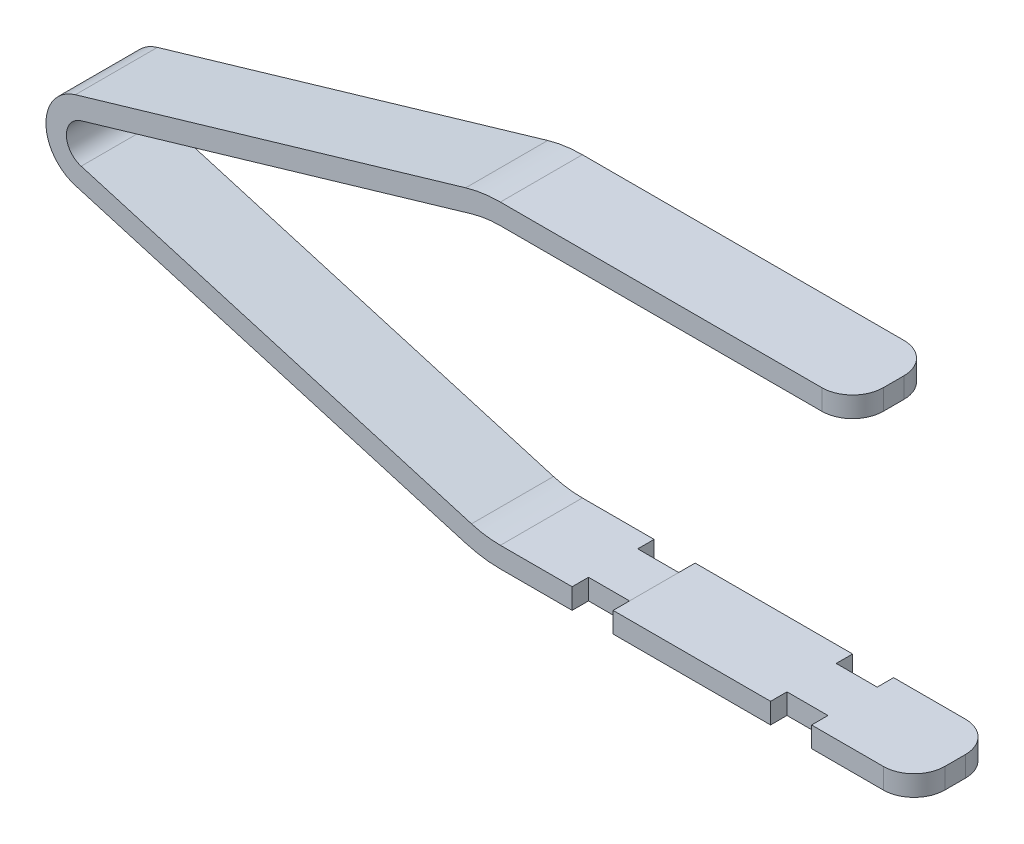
ISO-10303-21;
HEADER;
FILE_DESCRIPTION(('STEP AP214'),'2;1');
FILE_NAME('part.step','',(''),(''),'','','');
FILE_SCHEMA(('AUTOMOTIVE_DESIGN { 1 0 10303 214 1 1 1 1 }'));
ENDSEC;
DATA;
#1=APPLICATION_CONTEXT('core data for automotive mechanical design processes');
#2=APPLICATION_PROTOCOL_DEFINITION('international standard','automotive_design',2000,#1);
#3=PRODUCT_CONTEXT('',#1,'mechanical');
#4=PRODUCT('Part','Part','',(#3));
#5=PRODUCT_RELATED_PRODUCT_CATEGORY('part','',(#4));
#6=PRODUCT_DEFINITION_FORMATION('','',#4);
#7=PRODUCT_DEFINITION_CONTEXT('part definition',#1,'design');
#8=PRODUCT_DEFINITION('design','',#6,#7);
#9=PRODUCT_DEFINITION_SHAPE('','',#8);
#10=(LENGTH_UNIT() NAMED_UNIT(*) SI_UNIT(.MILLI.,.METRE.));
#11=(NAMED_UNIT(*) PLANE_ANGLE_UNIT() SI_UNIT($,.RADIAN.));
#12=(NAMED_UNIT(*) SI_UNIT($,.STERADIAN.) SOLID_ANGLE_UNIT());
#13=UNCERTAINTY_MEASURE_WITH_UNIT(LENGTH_MEASURE(1.E-05),#10,'distance_accuracy_value','');
#14=(GEOMETRIC_REPRESENTATION_CONTEXT(3) GLOBAL_UNCERTAINTY_ASSIGNED_CONTEXT((#13)) GLOBAL_UNIT_ASSIGNED_CONTEXT((#10,
#11,#12)) REPRESENTATION_CONTEXT('',''));
#15=CARTESIAN_POINT('',(0.,0.,0.));
#16=DIRECTION('',(0.,0.,1.));
#17=DIRECTION('',(1.,0.,0.));
#18=AXIS2_PLACEMENT_3D('',#15,#16,#17);
#19=CARTESIAN_POINT('',(60.2450998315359,-4.445,-5.08));
#20=DIRECTION('',(0.,0.,1.));
#21=DIRECTION('',(1.,0.,0.));
#22=AXIS2_PLACEMENT_3D('',#19,#20,#21);
#23=PLANE('',#22);
#24=DIRECTION('',(-1.,0.,0.));
#25=VECTOR('',#24,1.);
#26=CARTESIAN_POINT('',(60.2450998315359,17.145,-5.08));
#27=LINE('',#26,#25);
#28=CARTESIAN_POINT('',(100.076,17.145,-5.08));
#29=VERTEX_POINT('',#28);
#30=CARTESIAN_POINT('',(60.2450998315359,17.145,-5.08));
#31=VERTEX_POINT('',#30);
#32=EDGE_CURVE('E281',#29,#31,#27,.T.);
#33=ORIENTED_EDGE('',*,*,#32,.T.);
#34=CARTESIAN_POINT('',(60.2450998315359,4.445,-5.08));
#35=DIRECTION('',(0.,0.,1.));
#36=DIRECTION('',(-1.,0.,0.));
#37=AXIS2_PLACEMENT_3D('',#34,#35,#36);
#38=CIRCLE('',#37,12.7);
#39=CARTESIAN_POINT('',(56.6687593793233,16.6310489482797,-5.08));
#40=VERTEX_POINT('',#39);
#41=EDGE_CURVE('E619',#31,#40,#38,.T.);
#42=ORIENTED_EDGE('',*,*,#41,.T.);
#43=DIRECTION('',(-0.959531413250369,-0.281601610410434,0.));
#44=VECTOR('',#43,1.);
#45=CARTESIAN_POINT('',(8.30456669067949,2.43720978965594,-5.08));
#46=LINE('',#45,#44);
#47=CARTESIAN_POINT('',(8.30456669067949,2.43720978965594,-5.08));
#48=VERTEX_POINT('',#47);
#49=EDGE_CURVE('E624',#40,#48,#46,.T.);
#50=ORIENTED_EDGE('',*,*,#49,.T.);
#51=CARTESIAN_POINT('',(9.01983478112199,0.,-5.08));
#52=DIRECTION('',(0.,0.,1.));
#53=DIRECTION('',(1.,0.,0.));
#54=AXIS2_PLACEMENT_3D('',#51,#52,#53);
#55=CIRCLE('',#54,2.54);
#56=CARTESIAN_POINT('',(8.30456669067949,-2.43720978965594,-5.08));
#57=VERTEX_POINT('',#56);
#58=EDGE_CURVE('E627',#48,#57,#55,.T.);
#59=ORIENTED_EDGE('',*,*,#58,.T.);
#60=DIRECTION('',(0.959531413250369,-0.281601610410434,0.));
#61=VECTOR('',#60,1.);
#62=CARTESIAN_POINT('',(8.30456669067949,-2.43720978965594,-5.08));
#63=LINE('',#62,#61);
#64=CARTESIAN_POINT('',(56.6687593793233,-16.6310489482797,-5.08));
#65=VERTEX_POINT('',#64);
#66=EDGE_CURVE('E635',#57,#65,#63,.T.);
#67=ORIENTED_EDGE('',*,*,#66,.T.);
#68=CARTESIAN_POINT('',(60.2450998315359,-4.445,-5.08));
#69=DIRECTION('',(0.,0.,1.));
#70=DIRECTION('',(-1.,0.,0.));
#71=AXIS2_PLACEMENT_3D('',#68,#69,#70);
#72=CIRCLE('',#71,12.7);
#73=CARTESIAN_POINT('',(60.2450998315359,-17.145,-5.08));
#74=VERTEX_POINT('',#73);
#75=EDGE_CURVE('E264',#65,#74,#72,.T.);
#76=ORIENTED_EDGE('',*,*,#75,.T.);
#77=DIRECTION('',(1.,0.,0.));
#78=VECTOR('',#77,1.);
#79=CARTESIAN_POINT('',(60.2450998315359,-17.145,-5.08));
#80=LINE('',#79,#78);
#81=CARTESIAN_POINT('',(69.1350998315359,-17.145,-5.08));
#82=VERTEX_POINT('',#81);
#83=EDGE_CURVE('E230',#74,#82,#80,.T.);
#84=ORIENTED_EDGE('',*,*,#83,.T.);
#85=DIRECTION('',(0.,-1.,0.));
#86=VECTOR('',#85,1.);
#87=CARTESIAN_POINT('',(69.1350998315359,19.686,-5.08));
#88=LINE('',#87,#86);
#89=CARTESIAN_POINT('',(69.1350998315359,-19.685,-5.08));
#90=VERTEX_POINT('',#89);
#91=EDGE_CURVE('E240',#82,#90,#88,.T.);
#92=ORIENTED_EDGE('',*,*,#91,.T.);
#93=DIRECTION('',(1.,0.,0.));
#94=VECTOR('',#93,1.);
#95=CARTESIAN_POINT('',(60.2450998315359,-19.685,-5.08));
#96=LINE('',#95,#94);
#97=CARTESIAN_POINT('',(60.2450998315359,-19.685,-5.08));
#98=VERTEX_POINT('',#97);
#99=EDGE_CURVE('E225',#98,#90,#96,.T.);
#100=ORIENTED_EDGE('',*,*,#99,.F.);
#101=CARTESIAN_POINT('',(60.2450998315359,-4.445,-5.08));
#102=DIRECTION('',(0.,0.,1.));
#103=DIRECTION('',(1.,0.,0.));
#104=AXIS2_PLACEMENT_3D('',#101,#102,#103);
#105=CIRCLE('',#104,15.24);
#106=CARTESIAN_POINT('',(55.9534912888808,-19.0682587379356,-5.08));
#107=VERTEX_POINT('',#106);
#108=EDGE_CURVE('E262',#107,#98,#105,.T.);
#109=ORIENTED_EDGE('',*,*,#108,.F.);
#110=DIRECTION('',(0.959531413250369,-0.281601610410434,0.));
#111=VECTOR('',#110,1.);
#112=CARTESIAN_POINT('',(7.58929860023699,-4.87441957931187,-5.08));
#113=LINE('',#112,#111);
#114=CARTESIAN_POINT('',(7.58929860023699,-4.87441957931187,-5.08));
#115=VERTEX_POINT('',#114);
#116=EDGE_CURVE('E654',#115,#107,#113,.T.);
#117=ORIENTED_EDGE('',*,*,#116,.F.);
#118=CARTESIAN_POINT('',(9.01983478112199,0.,-5.08));
#119=DIRECTION('',(0.,0.,1.));
#120=DIRECTION('',(1.,0.,0.));
#121=AXIS2_PLACEMENT_3D('',#118,#119,#120);
#122=CIRCLE('',#121,5.08);
#123=CARTESIAN_POINT('',(7.58929860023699,4.87441957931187,-5.08));
#124=VERTEX_POINT('',#123);
#125=EDGE_CURVE('E650',#124,#115,#122,.T.);
#126=ORIENTED_EDGE('',*,*,#125,.F.);
#127=DIRECTION('',(-0.959531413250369,-0.281601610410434,0.));
#128=VECTOR('',#127,1.);
#129=CARTESIAN_POINT('',(7.58929860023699,4.87441957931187,-5.08));
#130=LINE('',#129,#128);
#131=CARTESIAN_POINT('',(55.9534912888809,19.0682587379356,-5.08));
#132=VERTEX_POINT('',#131);
#133=EDGE_CURVE('E629',#132,#124,#130,.T.);
#134=ORIENTED_EDGE('',*,*,#133,.F.);
#135=CARTESIAN_POINT('',(60.2450998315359,4.445,-5.08));
#136=DIRECTION('',(0.,0.,1.));
#137=DIRECTION('',(1.,0.,0.));
#138=AXIS2_PLACEMENT_3D('',#135,#136,#137);
#139=CIRCLE('',#138,15.24);
#140=CARTESIAN_POINT('',(60.2450998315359,19.685,-5.08));
#141=VERTEX_POINT('',#140);
#142=EDGE_CURVE('E625',#141,#132,#139,.T.);
#143=ORIENTED_EDGE('',*,*,#142,.F.);
#144=DIRECTION('',(1.,0.,0.));
#145=VECTOR('',#144,1.);
#146=CARTESIAN_POINT('',(60.2450998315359,19.685,-5.08));
#147=LINE('',#146,#145);
#148=CARTESIAN_POINT('',(100.076,19.685,-5.08));
#149=VERTEX_POINT('',#148);
#150=EDGE_CURVE('E284',#149,#141,#147,.F.);
#151=ORIENTED_EDGE('',*,*,#150,.F.);
#152=DIRECTION('',(0.,1.,0.));
#153=VECTOR('',#152,1.);
#154=CARTESIAN_POINT('',(100.076,17.145,-5.08));
#155=LINE('',#154,#153);
#156=EDGE_CURVE('E269',#149,#29,#155,.F.);
#157=ORIENTED_EDGE('',*,*,#156,.T.);
#158=EDGE_LOOP('',(#33,#42,#50,#59,#67,#76,#84,#92,#100,#109,#117,#126,#134,#143,#151,#157));
#159=FACE_BOUND('',#158,.T.);
#160=ADVANCED_FACE('F46',(#159),#23,.F.);
#161=CARTESIAN_POINT('',(60.2450998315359,-4.445,5.08));
#162=DIRECTION('',(0.,0.,1.));
#163=DIRECTION('',(1.,0.,0.));
#164=AXIS2_PLACEMENT_3D('',#161,#162,#163);
#165=PLANE('',#164);
#166=DIRECTION('',(1.,0.,0.));
#167=VECTOR('',#166,1.);
#168=CARTESIAN_POINT('',(60.2450998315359,19.685,5.08));
#169=LINE('',#168,#167);
#170=CARTESIAN_POINT('',(100.076,19.685,5.08));
#171=VERTEX_POINT('',#170);
#172=CARTESIAN_POINT('',(60.2450998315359,19.685,5.08));
#173=VERTEX_POINT('',#172);
#174=EDGE_CURVE('E50',#171,#173,#169,.F.);
#175=ORIENTED_EDGE('',*,*,#174,.T.);
#176=CARTESIAN_POINT('',(60.2450998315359,4.445,5.08));
#177=DIRECTION('',(0.,0.,1.));
#178=DIRECTION('',(1.,0.,0.));
#179=AXIS2_PLACEMENT_3D('',#176,#177,#178);
#180=CIRCLE('',#179,15.24);
#181=CARTESIAN_POINT('',(55.9534912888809,19.0682587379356,5.08));
#182=VERTEX_POINT('',#181);
#183=EDGE_CURVE('E294',#173,#182,#180,.T.);
#184=ORIENTED_EDGE('',*,*,#183,.T.);
#185=DIRECTION('',(-0.959531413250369,-0.281601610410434,0.));
#186=VECTOR('',#185,1.);
#187=CARTESIAN_POINT('',(7.58929860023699,4.87441957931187,5.08));
#188=LINE('',#187,#186);
#189=CARTESIAN_POINT('',(7.58929860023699,4.87441957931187,5.08));
#190=VERTEX_POINT('',#189);
#191=EDGE_CURVE('E311',#182,#190,#188,.T.);
#192=ORIENTED_EDGE('',*,*,#191,.T.);
#193=CARTESIAN_POINT('',(9.01983478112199,0.,5.08));
#194=DIRECTION('',(0.,0.,1.));
#195=DIRECTION('',(1.,0.,0.));
#196=AXIS2_PLACEMENT_3D('',#193,#194,#195);
#197=CIRCLE('',#196,5.08);
#198=CARTESIAN_POINT('',(7.58929860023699,-4.87441957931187,5.08));
#199=VERTEX_POINT('',#198);
#200=EDGE_CURVE('E316',#190,#199,#197,.T.);
#201=ORIENTED_EDGE('',*,*,#200,.T.);
#202=DIRECTION('',(0.959531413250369,-0.281601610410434,0.));
#203=VECTOR('',#202,1.);
#204=CARTESIAN_POINT('',(7.58929860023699,-4.87441957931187,5.08));
#205=LINE('',#204,#203);
#206=CARTESIAN_POINT('',(55.9534912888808,-19.0682587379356,5.08));
#207=VERTEX_POINT('',#206);
#208=EDGE_CURVE('E640',#199,#207,#205,.T.);
#209=ORIENTED_EDGE('',*,*,#208,.T.);
#210=CARTESIAN_POINT('',(60.2450998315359,-4.445,5.08));
#211=DIRECTION('',(0.,0.,1.));
#212=DIRECTION('',(1.,0.,0.));
#213=AXIS2_PLACEMENT_3D('',#210,#211,#212);
#214=CIRCLE('',#213,15.24);
#215=CARTESIAN_POINT('',(60.2450998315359,-19.685,5.08));
#216=VERTEX_POINT('',#215);
#217=EDGE_CURVE('E341',#207,#216,#214,.T.);
#218=ORIENTED_EDGE('',*,*,#217,.T.);
#219=DIRECTION('',(1.,0.,0.));
#220=VECTOR('',#219,1.);
#221=CARTESIAN_POINT('',(60.2450998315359,-19.685,5.08));
#222=LINE('',#221,#220);
#223=CARTESIAN_POINT('',(69.1350998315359,-19.685,5.08));
#224=VERTEX_POINT('',#223);
#225=EDGE_CURVE('E258',#216,#224,#222,.T.);
#226=ORIENTED_EDGE('',*,*,#225,.T.);
#227=DIRECTION('',(0.,-1.,0.));
#228=VECTOR('',#227,1.);
#229=CARTESIAN_POINT('',(69.1350998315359,19.686,5.08));
#230=LINE('',#229,#228);
#231=CARTESIAN_POINT('',(69.1350998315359,-17.145,5.08));
#232=VERTEX_POINT('',#231);
#233=EDGE_CURVE('E235',#232,#224,#230,.T.);
#234=ORIENTED_EDGE('',*,*,#233,.F.);
#235=DIRECTION('',(1.,0.,0.));
#236=VECTOR('',#235,1.);
#237=CARTESIAN_POINT('',(60.2450998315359,-17.145,5.08));
#238=LINE('',#237,#236);
#239=CARTESIAN_POINT('',(60.2450998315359,-17.145,5.08));
#240=VERTEX_POINT('',#239);
#241=EDGE_CURVE('E255',#240,#232,#238,.T.);
#242=ORIENTED_EDGE('',*,*,#241,.F.);
#243=CARTESIAN_POINT('',(60.2450998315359,-4.445,5.08));
#244=DIRECTION('',(0.,0.,1.));
#245=DIRECTION('',(-1.,0.,0.));
#246=AXIS2_PLACEMENT_3D('',#243,#244,#245);
#247=CIRCLE('',#246,12.7);
#248=CARTESIAN_POINT('',(56.6687593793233,-16.6310489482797,5.08));
#249=VERTEX_POINT('',#248);
#250=EDGE_CURVE('E259',#249,#240,#247,.T.);
#251=ORIENTED_EDGE('',*,*,#250,.F.);
#252=DIRECTION('',(0.959531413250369,-0.281601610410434,0.));
#253=VECTOR('',#252,1.);
#254=CARTESIAN_POINT('',(8.30456669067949,-2.43720978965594,5.08));
#255=LINE('',#254,#253);
#256=CARTESIAN_POINT('',(8.30456669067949,-2.43720978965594,5.08));
#257=VERTEX_POINT('',#256);
#258=EDGE_CURVE('E325',#257,#249,#255,.T.);
#259=ORIENTED_EDGE('',*,*,#258,.F.);
#260=CARTESIAN_POINT('',(9.01983478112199,0.,5.08));
#261=DIRECTION('',(0.,0.,1.));
#262=DIRECTION('',(1.,0.,0.));
#263=AXIS2_PLACEMENT_3D('',#260,#261,#262);
#264=CIRCLE('',#263,2.54);
#265=CARTESIAN_POINT('',(8.30456669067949,2.43720978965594,5.08));
#266=VERTEX_POINT('',#265);
#267=EDGE_CURVE('E322',#266,#257,#264,.T.);
#268=ORIENTED_EDGE('',*,*,#267,.F.);
#269=DIRECTION('',(-0.959531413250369,-0.281601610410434,0.));
#270=VECTOR('',#269,1.);
#271=CARTESIAN_POINT('',(8.30456669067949,2.43720978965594,5.08));
#272=LINE('',#271,#270);
#273=CARTESIAN_POINT('',(56.6687593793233,16.6310489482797,5.08));
#274=VERTEX_POINT('',#273);
#275=EDGE_CURVE('E314',#274,#266,#272,.T.);
#276=ORIENTED_EDGE('',*,*,#275,.F.);
#277=CARTESIAN_POINT('',(60.2450998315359,4.445,5.08));
#278=DIRECTION('',(0.,0.,1.));
#279=DIRECTION('',(-1.,0.,0.));
#280=AXIS2_PLACEMENT_3D('',#277,#278,#279);
#281=CIRCLE('',#280,12.7);
#282=CARTESIAN_POINT('',(60.2450998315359,17.145,5.08));
#283=VERTEX_POINT('',#282);
#284=EDGE_CURVE('E310',#283,#274,#281,.T.);
#285=ORIENTED_EDGE('',*,*,#284,.F.);
#286=DIRECTION('',(-1.,0.,0.));
#287=VECTOR('',#286,1.);
#288=CARTESIAN_POINT('',(60.2450998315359,17.145,5.08));
#289=LINE('',#288,#287);
#290=CARTESIAN_POINT('',(100.076,17.145,5.08));
#291=VERTEX_POINT('',#290);
#292=EDGE_CURVE('E285',#291,#283,#289,.T.);
#293=ORIENTED_EDGE('',*,*,#292,.F.);
#294=DIRECTION('',(0.,-1.,0.));
#295=VECTOR('',#294,1.);
#296=CARTESIAN_POINT('',(100.076,-4.445,5.08));
#297=LINE('',#296,#295);
#298=EDGE_CURVE('E248',#291,#171,#297,.F.);
#299=ORIENTED_EDGE('',*,*,#298,.T.);
#300=EDGE_LOOP('',(#175,#184,#192,#201,#209,#218,#226,#234,#242,#251,#259,#268,#276,#285,#293,#299));
#301=FACE_BOUND('',#300,.T.);
#302=ADVANCED_FACE('F292',(#301),#165,.T.);
#303=CARTESIAN_POINT('',(60.2450998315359,17.145,5.08));
#304=DIRECTION('',(0.,-1.,0.));
#305=DIRECTION('',(0.,0.,-1.));
#306=AXIS2_PLACEMENT_3D('',#303,#304,#305);
#307=PLANE('',#306);
#308=ORIENTED_EDGE('',*,*,#292,.T.);
#309=DIRECTION('',(0.,0.,-1.));
#310=VECTOR('',#309,1.);
#311=CARTESIAN_POINT('',(60.2450998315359,17.145,5.08));
#312=LINE('',#311,#310);
#313=EDGE_CURVE('E305',#283,#31,#312,.T.);
#314=ORIENTED_EDGE('',*,*,#313,.T.);
#315=ORIENTED_EDGE('',*,*,#32,.F.);
#316=CARTESIAN_POINT('',(100.076,17.145,-1.27));
#317=DIRECTION('',(0.,-1.,0.));
#318=DIRECTION('',(0.,0.,-1.));
#319=AXIS2_PLACEMENT_3D('',#316,#317,#318);
#320=CIRCLE('',#319,3.81);
#321=CARTESIAN_POINT('',(103.886,17.145,-1.27));
#322=VERTEX_POINT('',#321);
#323=EDGE_CURVE('E71',#29,#322,#320,.T.);
#324=ORIENTED_EDGE('',*,*,#323,.T.);
#325=DIRECTION('',(0.,0.,-1.));
#326=VECTOR('',#325,1.);
#327=CARTESIAN_POINT('',(103.886,17.145,5.08));
#328=LINE('',#327,#326);
#329=CARTESIAN_POINT('',(103.886,17.145,1.27));
#330=VERTEX_POINT('',#329);
#331=EDGE_CURVE('E13',#330,#322,#328,.T.);
#332=ORIENTED_EDGE('',*,*,#331,.F.);
#333=CARTESIAN_POINT('',(100.076,17.145,1.27));
#334=DIRECTION('',(0.,-1.,0.));
#335=DIRECTION('',(0.,0.,-1.));
#336=AXIS2_PLACEMENT_3D('',#333,#334,#335);
#337=CIRCLE('',#336,3.81);
#338=EDGE_CURVE('E63',#330,#291,#337,.T.);
#339=ORIENTED_EDGE('',*,*,#338,.T.);
#340=EDGE_LOOP('',(#308,#314,#315,#324,#332,#339));
#341=FACE_BOUND('',#340,.T.);
#342=ADVANCED_FACE('F48',(#341),#307,.T.);
#343=CARTESIAN_POINT('',(60.2450998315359,19.685,5.08));
#344=DIRECTION('',(0.,-1.,0.));
#345=DIRECTION('',(0.,0.,-1.));
#346=AXIS2_PLACEMENT_3D('',#343,#344,#345);
#347=PLANE('',#346);
#348=ORIENTED_EDGE('',*,*,#150,.T.);
#349=DIRECTION('',(0.,0.,-1.));
#350=VECTOR('',#349,1.);
#351=CARTESIAN_POINT('',(60.2450998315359,19.685,5.08));
#352=LINE('',#351,#350);
#353=EDGE_CURVE('E299',#173,#141,#352,.T.);
#354=ORIENTED_EDGE('',*,*,#353,.F.);
#355=ORIENTED_EDGE('',*,*,#174,.F.);
#356=CARTESIAN_POINT('',(100.076,19.685,1.27));
#357=DIRECTION('',(0.,-1.,0.));
#358=DIRECTION('',(0.,0.,-1.));
#359=AXIS2_PLACEMENT_3D('',#356,#357,#358);
#360=CIRCLE('',#359,3.81);
#361=CARTESIAN_POINT('',(103.886,19.685,1.27));
#362=VERTEX_POINT('',#361);
#363=EDGE_CURVE('E273',#171,#362,#360,.F.);
#364=ORIENTED_EDGE('',*,*,#363,.T.);
#365=DIRECTION('',(0.,0.,1.));
#366=VECTOR('',#365,1.);
#367=CARTESIAN_POINT('',(103.886,19.685,-5.08));
#368=LINE('',#367,#366);
#369=CARTESIAN_POINT('',(103.886,19.685,-1.27));
#370=VERTEX_POINT('',#369);
#371=EDGE_CURVE('E55',#370,#362,#368,.T.);
#372=ORIENTED_EDGE('',*,*,#371,.F.);
#373=CARTESIAN_POINT('',(100.076,19.685,-1.27));
#374=DIRECTION('',(0.,-1.,0.));
#375=DIRECTION('',(0.,0.,-1.));
#376=AXIS2_PLACEMENT_3D('',#373,#374,#375);
#377=CIRCLE('',#376,3.81);
#378=EDGE_CURVE('E271',#370,#149,#377,.F.);
#379=ORIENTED_EDGE('',*,*,#378,.T.);
#380=EDGE_LOOP('',(#348,#354,#355,#364,#372,#379));
#381=FACE_BOUND('',#380,.T.);
#382=ADVANCED_FACE('F300',(#381),#347,.F.);
#383=CARTESIAN_POINT('',(103.886,17.145,-5.08));
#384=DIRECTION('',(1.,0.,0.));
#385=DIRECTION('',(0.,0.,-1.));
#386=AXIS2_PLACEMENT_3D('',#383,#384,#385);
#387=PLANE('',#386);
#388=ORIENTED_EDGE('',*,*,#331,.T.);
#389=DIRECTION('',(0.,1.,0.));
#390=VECTOR('',#389,1.);
#391=CARTESIAN_POINT('',(103.886,19.685,-1.27));
#392=LINE('',#391,#390);
#393=EDGE_CURVE('E275',#322,#370,#392,.T.);
#394=ORIENTED_EDGE('',*,*,#393,.T.);
#395=ORIENTED_EDGE('',*,*,#371,.T.);
#396=DIRECTION('',(0.,-1.,0.));
#397=VECTOR('',#396,1.);
#398=CARTESIAN_POINT('',(103.886,17.145,1.27));
#399=LINE('',#398,#397);
#400=EDGE_CURVE('E278',#362,#330,#399,.T.);
#401=ORIENTED_EDGE('',*,*,#400,.T.);
#402=EDGE_LOOP('',(#388,#394,#395,#401));
#403=FACE_BOUND('',#402,.T.);
#404=ADVANCED_FACE('F377',(#403),#387,.T.);
#405=CARTESIAN_POINT('',(100.076,17.145,-1.27));
#406=DIRECTION('',(0.,-1.,0.));
#407=DIRECTION('',(0.,0.,-1.));
#408=AXIS2_PLACEMENT_3D('',#405,#406,#407);
#409=CYLINDRICAL_SURFACE('',#408,3.81);
#410=ORIENTED_EDGE('',*,*,#323,.F.);
#411=ORIENTED_EDGE('',*,*,#156,.F.);
#412=ORIENTED_EDGE('',*,*,#378,.F.);
#413=ORIENTED_EDGE('',*,*,#393,.F.);
#414=EDGE_LOOP('',(#410,#411,#412,#413));
#415=FACE_BOUND('',#414,.T.);
#416=ADVANCED_FACE('F384',(#415),#409,.T.);
#417=CARTESIAN_POINT('',(100.076,17.145,1.27));
#418=DIRECTION('',(0.,-1.,0.));
#419=DIRECTION('',(0.,0.,-1.));
#420=AXIS2_PLACEMENT_3D('',#417,#418,#419);
#421=CYLINDRICAL_SURFACE('',#420,3.81);
#422=ORIENTED_EDGE('',*,*,#363,.F.);
#423=ORIENTED_EDGE('',*,*,#298,.F.);
#424=ORIENTED_EDGE('',*,*,#338,.F.);
#425=ORIENTED_EDGE('',*,*,#400,.F.);
#426=EDGE_LOOP('',(#422,#423,#424,#425));
#427=FACE_BOUND('',#426,.T.);
#428=ADVANCED_FACE('F402',(#427),#421,.T.);
#429=CARTESIAN_POINT('',(74.2150998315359,-19.685,-5.08));
#430=DIRECTION('',(-1.,0.,0.));
#431=DIRECTION('',(0.,0.,1.));
#432=AXIS2_PLACEMENT_3D('',#429,#430,#431);
#433=PLANE('',#432);
#434=DIRECTION('',(0.,0.,1.));
#435=VECTOR('',#434,1.);
#436=CARTESIAN_POINT('',(74.2150998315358,-19.685,5.0800000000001));
#437=LINE('',#436,#435);
#438=CARTESIAN_POINT('',(74.2150998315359,-19.685,-3.048));
#439=VERTEX_POINT('',#438);
#440=CARTESIAN_POINT('',(74.2150998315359,-19.685,3.048));
#441=VERTEX_POINT('',#440);
#442=EDGE_CURVE('E203',#439,#441,#437,.T.);
#443=ORIENTED_EDGE('',*,*,#442,.F.);
#444=DIRECTION('',(0.,-1.,0.));
#445=VECTOR('',#444,1.);
#446=CARTESIAN_POINT('',(74.2150998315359,19.686,-3.048));
#447=LINE('',#446,#445);
#448=CARTESIAN_POINT('',(74.2150998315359,-17.145,-3.048));
#449=VERTEX_POINT('',#448);
#450=EDGE_CURVE('E239',#449,#439,#447,.T.);
#451=ORIENTED_EDGE('',*,*,#450,.F.);
#452=DIRECTION('',(0.,0.,1.));
#453=VECTOR('',#452,1.);
#454=CARTESIAN_POINT('',(74.2150998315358,-17.145,5.0800000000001));
#455=LINE('',#454,#453);
#456=CARTESIAN_POINT('',(74.2150998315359,-17.145,3.048));
#457=VERTEX_POINT('',#456);
#458=EDGE_CURVE('E205',#449,#457,#455,.T.);
#459=ORIENTED_EDGE('',*,*,#458,.T.);
#460=DIRECTION('',(0.,-1.,0.));
#461=VECTOR('',#460,1.);
#462=CARTESIAN_POINT('',(74.2150998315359,19.686,3.048));
#463=LINE('',#462,#461);
#464=EDGE_CURVE('E199',#457,#441,#463,.T.);
#465=ORIENTED_EDGE('',*,*,#464,.T.);
#466=EDGE_LOOP('',(#443,#451,#459,#465));
#467=FACE_BOUND('',#466,.T.);
#468=ADVANCED_FACE('F201',(#467),#433,.F.);
#469=CARTESIAN_POINT('',(8.30456669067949,2.43720978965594,5.08));
#470=DIRECTION('',(0.281601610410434,-0.959531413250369,0.));
#471=DIRECTION('',(0.959531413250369,0.281601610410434,0.));
#472=AXIS2_PLACEMENT_3D('',#469,#470,#471);
#473=PLANE('',#472);
#474=ORIENTED_EDGE('',*,*,#49,.F.);
#475=DIRECTION('',(0.,0.,-1.));
#476=VECTOR('',#475,1.);
#477=CARTESIAN_POINT('',(56.6687593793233,16.6310489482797,5.08));
#478=LINE('',#477,#476);
#479=EDGE_CURVE('E621',#274,#40,#478,.T.);
#480=ORIENTED_EDGE('',*,*,#479,.F.);
#481=ORIENTED_EDGE('',*,*,#275,.T.);
#482=DIRECTION('',(0.,0.,-1.));
#483=VECTOR('',#482,1.);
#484=CARTESIAN_POINT('',(8.30456669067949,2.43720978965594,5.08));
#485=LINE('',#484,#483);
#486=EDGE_CURVE('E665',#266,#48,#485,.T.);
#487=ORIENTED_EDGE('',*,*,#486,.T.);
#488=EDGE_LOOP('',(#474,#480,#481,#487));
#489=FACE_BOUND('',#488,.T.);
#490=ADVANCED_FACE('F428',(#489),#473,.T.);
#491=CARTESIAN_POINT('',(9.01983478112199,0.,5.08));
#492=DIRECTION('',(0.,0.,-1.));
#493=DIRECTION('',(-1.,0.,0.));
#494=AXIS2_PLACEMENT_3D('',#491,#492,#493);
#495=CYLINDRICAL_SURFACE('',#494,2.54);
#496=ORIENTED_EDGE('',*,*,#58,.F.);
#497=ORIENTED_EDGE('',*,*,#486,.F.);
#498=ORIENTED_EDGE('',*,*,#267,.T.);
#499=DIRECTION('',(0.,0.,-1.));
#500=VECTOR('',#499,1.);
#501=CARTESIAN_POINT('',(8.30456669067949,-2.43720978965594,5.08));
#502=LINE('',#501,#500);
#503=EDGE_CURVE('E667',#257,#57,#502,.T.);
#504=ORIENTED_EDGE('',*,*,#503,.T.);
#505=EDGE_LOOP('',(#496,#497,#498,#504));
#506=FACE_BOUND('',#505,.T.);
#507=ADVANCED_FACE('F433',(#506),#495,.F.);
#508=CARTESIAN_POINT('',(8.30456669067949,-2.43720978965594,5.08));
#509=DIRECTION('',(0.281601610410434,0.959531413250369,0.));
#510=DIRECTION('',(-0.959531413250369,0.281601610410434,0.));
#511=AXIS2_PLACEMENT_3D('',#508,#509,#510);
#512=PLANE('',#511);
#513=ORIENTED_EDGE('',*,*,#66,.F.);
#514=ORIENTED_EDGE('',*,*,#503,.F.);
#515=ORIENTED_EDGE('',*,*,#258,.T.);
#516=DIRECTION('',(0.,0.,-1.));
#517=VECTOR('',#516,1.);
#518=CARTESIAN_POINT('',(56.6687593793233,-16.6310489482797,5.08));
#519=LINE('',#518,#517);
#520=EDGE_CURVE('E669',#249,#65,#519,.T.);
#521=ORIENTED_EDGE('',*,*,#520,.T.);
#522=EDGE_LOOP('',(#513,#514,#515,#521));
#523=FACE_BOUND('',#522,.T.);
#524=ADVANCED_FACE('F440',(#523),#512,.T.);
#525=CARTESIAN_POINT('',(7.58929860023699,-4.87441957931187,5.08));
#526=DIRECTION('',(0.281601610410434,0.959531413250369,0.));
#527=DIRECTION('',(-0.959531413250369,0.281601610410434,0.));
#528=AXIS2_PLACEMENT_3D('',#525,#526,#527);
#529=PLANE('',#528);
#530=ORIENTED_EDGE('',*,*,#116,.T.);
#531=DIRECTION('',(0.,0.,-1.));
#532=VECTOR('',#531,1.);
#533=CARTESIAN_POINT('',(55.9534912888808,-19.0682587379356,5.08));
#534=LINE('',#533,#532);
#535=EDGE_CURVE('E347',#207,#107,#534,.T.);
#536=ORIENTED_EDGE('',*,*,#535,.F.);
#537=ORIENTED_EDGE('',*,*,#208,.F.);
#538=DIRECTION('',(0.,0.,-1.));
#539=VECTOR('',#538,1.);
#540=CARTESIAN_POINT('',(7.58929860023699,-4.87441957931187,5.08));
#541=LINE('',#540,#539);
#542=EDGE_CURVE('E648',#199,#115,#541,.T.);
#543=ORIENTED_EDGE('',*,*,#542,.T.);
#544=EDGE_LOOP('',(#530,#536,#537,#543));
#545=FACE_BOUND('',#544,.T.);
#546=ADVANCED_FACE('F447',(#545),#529,.F.);
#547=CARTESIAN_POINT('',(9.01983478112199,0.,5.08));
#548=DIRECTION('',(0.,0.,-1.));
#549=DIRECTION('',(-1.,0.,0.));
#550=AXIS2_PLACEMENT_3D('',#547,#548,#549);
#551=CYLINDRICAL_SURFACE('',#550,5.08);
#552=ORIENTED_EDGE('',*,*,#125,.T.);
#553=ORIENTED_EDGE('',*,*,#542,.F.);
#554=ORIENTED_EDGE('',*,*,#200,.F.);
#555=DIRECTION('',(0.,0.,-1.));
#556=VECTOR('',#555,1.);
#557=CARTESIAN_POINT('',(7.58929860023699,4.87441957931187,5.08));
#558=LINE('',#557,#556);
#559=EDGE_CURVE('E651',#190,#124,#558,.T.);
#560=ORIENTED_EDGE('',*,*,#559,.T.);
#561=EDGE_LOOP('',(#552,#553,#554,#560));
#562=FACE_BOUND('',#561,.T.);
#563=ADVANCED_FACE('F454',(#562),#551,.T.);
#564=CARTESIAN_POINT('',(7.58929860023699,4.87441957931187,5.08));
#565=DIRECTION('',(0.281601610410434,-0.959531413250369,0.));
#566=DIRECTION('',(0.959531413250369,0.281601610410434,0.));
#567=AXIS2_PLACEMENT_3D('',#564,#565,#566);
#568=PLANE('',#567);
#569=ORIENTED_EDGE('',*,*,#133,.T.);
#570=ORIENTED_EDGE('',*,*,#559,.F.);
#571=ORIENTED_EDGE('',*,*,#191,.F.);
#572=DIRECTION('',(0.,0.,-1.));
#573=VECTOR('',#572,1.);
#574=CARTESIAN_POINT('',(55.9534912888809,19.0682587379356,5.08));
#575=LINE('',#574,#573);
#576=EDGE_CURVE('E304',#182,#132,#575,.T.);
#577=ORIENTED_EDGE('',*,*,#576,.T.);
#578=EDGE_LOOP('',(#569,#570,#571,#577));
#579=FACE_BOUND('',#578,.T.);
#580=ADVANCED_FACE('F461',(#579),#568,.F.);
#581=CARTESIAN_POINT('',(60.2450998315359,-4.445,5.08));
#582=DIRECTION('',(0.,0.,-1.));
#583=DIRECTION('',(-1.,0.,0.));
#584=AXIS2_PLACEMENT_3D('',#581,#582,#583);
#585=CYLINDRICAL_SURFACE('',#584,15.24);
#586=ORIENTED_EDGE('',*,*,#108,.T.);
#587=DIRECTION('',(0.,0.,-1.));
#588=VECTOR('',#587,1.);
#589=CARTESIAN_POINT('',(60.2450998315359,-19.685,5.08));
#590=LINE('',#589,#588);
#591=EDGE_CURVE('E344',#216,#98,#590,.T.);
#592=ORIENTED_EDGE('',*,*,#591,.F.);
#593=ORIENTED_EDGE('',*,*,#217,.F.);
#594=ORIENTED_EDGE('',*,*,#535,.T.);
#595=EDGE_LOOP('',(#586,#592,#593,#594));
#596=FACE_BOUND('',#595,.T.);
#597=ADVANCED_FACE('F468',(#596),#585,.T.);
#598=CARTESIAN_POINT('',(60.2450998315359,-4.445,5.08));
#599=DIRECTION('',(0.,0.,-1.));
#600=DIRECTION('',(-1.,0.,0.));
#601=AXIS2_PLACEMENT_3D('',#598,#599,#600);
#602=CYLINDRICAL_SURFACE('',#601,12.7);
#603=ORIENTED_EDGE('',*,*,#75,.F.);
#604=ORIENTED_EDGE('',*,*,#520,.F.);
#605=ORIENTED_EDGE('',*,*,#250,.T.);
#606=DIRECTION('',(0.,0.,-1.));
#607=VECTOR('',#606,1.);
#608=CARTESIAN_POINT('',(60.2450998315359,-17.145,5.08));
#609=LINE('',#608,#607);
#610=EDGE_CURVE('E218',#240,#74,#609,.T.);
#611=ORIENTED_EDGE('',*,*,#610,.T.);
#612=EDGE_LOOP('',(#603,#604,#605,#611));
#613=FACE_BOUND('',#612,.T.);
#614=ADVANCED_FACE('F475',(#613),#602,.F.);
#615=CARTESIAN_POINT('',(60.2450998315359,4.445,5.08));
#616=DIRECTION('',(0.,0.,-1.));
#617=DIRECTION('',(-1.,0.,0.));
#618=AXIS2_PLACEMENT_3D('',#615,#616,#617);
#619=CYLINDRICAL_SURFACE('',#618,12.7);
#620=ORIENTED_EDGE('',*,*,#41,.F.);
#621=ORIENTED_EDGE('',*,*,#313,.F.);
#622=ORIENTED_EDGE('',*,*,#284,.T.);
#623=ORIENTED_EDGE('',*,*,#479,.T.);
#624=EDGE_LOOP('',(#620,#621,#622,#623));
#625=FACE_BOUND('',#624,.T.);
#626=ADVANCED_FACE('F481',(#625),#619,.F.);
#627=CARTESIAN_POINT('',(60.2450998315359,4.445,5.08));
#628=DIRECTION('',(0.,0.,-1.));
#629=DIRECTION('',(-1.,0.,0.));
#630=AXIS2_PLACEMENT_3D('',#627,#628,#629);
#631=CYLINDRICAL_SURFACE('',#630,15.24);
#632=ORIENTED_EDGE('',*,*,#142,.T.);
#633=ORIENTED_EDGE('',*,*,#576,.F.);
#634=ORIENTED_EDGE('',*,*,#183,.F.);
#635=ORIENTED_EDGE('',*,*,#353,.T.);
#636=EDGE_LOOP('',(#632,#633,#634,#635));
#637=FACE_BOUND('',#636,.T.);
#638=ADVANCED_FACE('F307',(#637),#631,.T.);
#639=CARTESIAN_POINT('',(60.2450998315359,-17.145,5.08));
#640=DIRECTION('',(0.,1.,0.));
#641=DIRECTION('',(0.,0.,1.));
#642=AXIS2_PLACEMENT_3D('',#639,#640,#641);
#643=PLANE('',#642);
#644=ORIENTED_EDGE('',*,*,#458,.F.);
#645=DIRECTION('',(-1.,0.,0.));
#646=VECTOR('',#645,1.);
#647=CARTESIAN_POINT('',(69.1350998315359,-17.145,-3.048));
#648=LINE('',#647,#646);
#649=CARTESIAN_POINT('',(69.1350998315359,-17.145,-3.048));
#650=VERTEX_POINT('',#649);
#651=EDGE_CURVE('E238',#449,#650,#648,.T.);
#652=ORIENTED_EDGE('',*,*,#651,.T.);
#653=DIRECTION('',(0.,0.,-1.));
#654=VECTOR('',#653,1.);
#655=CARTESIAN_POINT('',(69.1350998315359,-17.145,-5.08));
#656=LINE('',#655,#654);
#657=EDGE_CURVE('E243',#650,#82,#656,.T.);
#658=ORIENTED_EDGE('',*,*,#657,.T.);
#659=ORIENTED_EDGE('',*,*,#83,.F.);
#660=ORIENTED_EDGE('',*,*,#610,.F.);
#661=ORIENTED_EDGE('',*,*,#241,.T.);
#662=DIRECTION('',(0.,0.,-1.));
#663=VECTOR('',#662,1.);
#664=CARTESIAN_POINT('',(69.1350998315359,-17.145,5.08));
#665=LINE('',#664,#663);
#666=CARTESIAN_POINT('',(69.1350998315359,-17.145,3.048));
#667=VERTEX_POINT('',#666);
#668=EDGE_CURVE('E252',#232,#667,#665,.T.);
#669=ORIENTED_EDGE('',*,*,#668,.T.);
#670=DIRECTION('',(1.,0.,0.));
#671=VECTOR('',#670,1.);
#672=CARTESIAN_POINT('',(69.1350998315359,-17.145,3.048));
#673=LINE('',#672,#671);
#674=EDGE_CURVE('E227',#667,#457,#673,.T.);
#675=ORIENTED_EDGE('',*,*,#674,.T.);
#676=EDGE_LOOP('',(#644,#652,#658,#659,#660,#661,#669,#675));
#677=FACE_BOUND('',#676,.T.);
#678=ADVANCED_FACE('F333',(#677),#643,.T.);
#679=CARTESIAN_POINT('',(69.1350998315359,19.686,-5.08));
#680=DIRECTION('',(-1.,0.,0.));
#681=DIRECTION('',(0.,-1.,0.));
#682=AXIS2_PLACEMENT_3D('',#679,#680,#681);
#683=PLANE('',#682);
#684=DIRECTION('',(0.,-1.,0.));
#685=VECTOR('',#684,1.);
#686=CARTESIAN_POINT('',(69.1350998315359,19.686,-3.048));
#687=LINE('',#686,#685);
#688=CARTESIAN_POINT('',(69.1350998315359,-19.685,-3.048));
#689=VERTEX_POINT('',#688);
#690=EDGE_CURVE('E236',#650,#689,#687,.T.);
#691=ORIENTED_EDGE('',*,*,#690,.T.);
#692=DIRECTION('',(0.,0.,-1.));
#693=VECTOR('',#692,1.);
#694=CARTESIAN_POINT('',(69.1350998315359,-19.685,-5.08));
#695=LINE('',#694,#693);
#696=EDGE_CURVE('E250',#689,#90,#695,.T.);
#697=ORIENTED_EDGE('',*,*,#696,.T.);
#698=ORIENTED_EDGE('',*,*,#91,.F.);
#699=ORIENTED_EDGE('',*,*,#657,.F.);
#700=EDGE_LOOP('',(#691,#697,#698,#699));
#701=FACE_BOUND('',#700,.T.);
#702=ADVANCED_FACE('F355',(#701),#683,.F.);
#703=CARTESIAN_POINT('',(60.2450998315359,-19.685,5.08));
#704=DIRECTION('',(0.,1.,0.));
#705=DIRECTION('',(0.,0.,1.));
#706=AXIS2_PLACEMENT_3D('',#703,#704,#705);
#707=PLANE('',#706);
#708=DIRECTION('',(-1.,0.,0.));
#709=VECTOR('',#708,1.);
#710=CARTESIAN_POINT('',(69.1350998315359,-19.685,-3.048));
#711=LINE('',#710,#709);
#712=EDGE_CURVE('E217',#439,#689,#711,.T.);
#713=ORIENTED_EDGE('',*,*,#712,.F.);
#714=ORIENTED_EDGE('',*,*,#442,.T.);
#715=DIRECTION('',(1.,0.,0.));
#716=VECTOR('',#715,1.);
#717=CARTESIAN_POINT('',(69.1350998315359,-19.685,3.048));
#718=LINE('',#717,#716);
#719=CARTESIAN_POINT('',(69.1350998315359,-19.685,3.048));
#720=VERTEX_POINT('',#719);
#721=EDGE_CURVE('E214',#720,#441,#718,.T.);
#722=ORIENTED_EDGE('',*,*,#721,.F.);
#723=DIRECTION('',(0.,0.,-1.));
#724=VECTOR('',#723,1.);
#725=CARTESIAN_POINT('',(69.1350998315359,-19.685,5.08));
#726=LINE('',#725,#724);
#727=EDGE_CURVE('E224',#224,#720,#726,.T.);
#728=ORIENTED_EDGE('',*,*,#727,.F.);
#729=ORIENTED_EDGE('',*,*,#225,.F.);
#730=ORIENTED_EDGE('',*,*,#591,.T.);
#731=ORIENTED_EDGE('',*,*,#99,.T.);
#732=ORIENTED_EDGE('',*,*,#696,.F.);
#733=EDGE_LOOP('',(#713,#714,#722,#728,#729,#730,#731,#732));
#734=FACE_BOUND('',#733,.T.);
#735=ADVANCED_FACE('F212',(#734),#707,.F.);
#736=CARTESIAN_POINT('',(69.1350998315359,19.686,-3.048));
#737=DIRECTION('',(0.,0.,1.));
#738=DIRECTION('',(1.,0.,0.));
#739=AXIS2_PLACEMENT_3D('',#736,#737,#738);
#740=PLANE('',#739);
#741=ORIENTED_EDGE('',*,*,#450,.T.);
#742=ORIENTED_EDGE('',*,*,#712,.T.);
#743=ORIENTED_EDGE('',*,*,#690,.F.);
#744=ORIENTED_EDGE('',*,*,#651,.F.);
#745=EDGE_LOOP('',(#741,#742,#743,#744));
#746=FACE_BOUND('',#745,.T.);
#747=ADVANCED_FACE('F359',(#746),#740,.F.);
#748=CARTESIAN_POINT('',(69.1350998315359,19.686,5.08));
#749=DIRECTION('',(-1.,0.,0.));
#750=DIRECTION('',(0.,-1.,0.));
#751=AXIS2_PLACEMENT_3D('',#748,#749,#750);
#752=PLANE('',#751);
#753=ORIENTED_EDGE('',*,*,#233,.T.);
#754=ORIENTED_EDGE('',*,*,#727,.T.);
#755=DIRECTION('',(0.,-1.,0.));
#756=VECTOR('',#755,1.);
#757=CARTESIAN_POINT('',(69.1350998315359,19.686,3.048));
#758=LINE('',#757,#756);
#759=EDGE_CURVE('E222',#667,#720,#758,.T.);
#760=ORIENTED_EDGE('',*,*,#759,.F.);
#761=ORIENTED_EDGE('',*,*,#668,.F.);
#762=EDGE_LOOP('',(#753,#754,#760,#761));
#763=FACE_BOUND('',#762,.T.);
#764=ADVANCED_FACE('F337',(#763),#752,.F.);
#765=CARTESIAN_POINT('',(69.1350998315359,19.686,3.048));
#766=DIRECTION('',(0.,0.,-1.));
#767=DIRECTION('',(-1.,0.,0.));
#768=AXIS2_PLACEMENT_3D('',#765,#766,#767);
#769=PLANE('',#768);
#770=ORIENTED_EDGE('',*,*,#759,.T.);
#771=ORIENTED_EDGE('',*,*,#721,.T.);
#772=ORIENTED_EDGE('',*,*,#464,.F.);
#773=ORIENTED_EDGE('',*,*,#674,.F.);
#774=EDGE_LOOP('',(#770,#771,#772,#773));
#775=FACE_BOUND('',#774,.T.);
#776=ADVANCED_FACE('F220',(#775),#769,.F.);
#777=CLOSED_SHELL('',(#160,#302,#342,#382,#404,#416,#428,#468,#490,#507,#524,#546,#563,#580,
#597,#614,#626,#638,#678,#702,#735,#747,#764,#776));
#778=MANIFOLD_SOLID_BREP('B2',#777);
#779=CARTESIAN_POINT('',(60.2450998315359,-4.445,-5.08));
#780=DIRECTION('',(0.,0.,1.));
#781=DIRECTION('',(1.,0.,0.));
#782=AXIS2_PLACEMENT_3D('',#779,#780,#781);
#783=PLANE('',#782);
#784=DIRECTION('',(1.,0.,0.));
#785=VECTOR('',#784,1.);
#786=CARTESIAN_POINT('',(60.2450998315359,-17.145,-5.08));
#787=LINE('',#786,#785);
#788=CARTESIAN_POINT('',(74.2150998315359,-17.145,-5.08));
#789=VERTEX_POINT('',#788);
#790=CARTESIAN_POINT('',(93.726,-17.145,-5.08));
#791=VERTEX_POINT('',#790);
#792=EDGE_CURVE('E863',#789,#791,#787,.T.);
#793=ORIENTED_EDGE('',*,*,#792,.T.);
#794=DIRECTION('',(0.,-1.,0.));
#795=VECTOR('',#794,1.);
#796=CARTESIAN_POINT('',(93.726,19.686,-5.07999999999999));
#797=LINE('',#796,#795);
#798=CARTESIAN_POINT('',(93.726,-19.685,-5.08));
#799=VERTEX_POINT('',#798);
#800=EDGE_CURVE('E824',#791,#799,#797,.T.);
#801=ORIENTED_EDGE('',*,*,#800,.T.);
#802=DIRECTION('',(1.,0.,0.));
#803=VECTOR('',#802,1.);
#804=CARTESIAN_POINT('',(60.2450998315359,-19.685,-5.08));
#805=LINE('',#804,#803);
#806=CARTESIAN_POINT('',(74.2150998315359,-19.685,-5.08));
#807=VERTEX_POINT('',#806);
#808=EDGE_CURVE('E867',#807,#799,#805,.T.);
#809=ORIENTED_EDGE('',*,*,#808,.F.);
#810=DIRECTION('',(0.,-1.,0.));
#811=VECTOR('',#810,1.);
#812=CARTESIAN_POINT('',(74.2150998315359,19.686,-5.08));
#813=LINE('',#812,#811);
#814=EDGE_CURVE('E826',#789,#807,#813,.T.);
#815=ORIENTED_EDGE('',*,*,#814,.F.);
#816=EDGE_LOOP('',(#793,#801,#809,#815));
#817=FACE_BOUND('',#816,.T.);
#818=ADVANCED_FACE('F683',(#817),#783,.F.);
#819=CARTESIAN_POINT('',(93.726,19.686,-5.07999999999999));
#820=DIRECTION('',(-1.,0.,0.));
#821=DIRECTION('',(0.,0.,1.));
#822=AXIS2_PLACEMENT_3D('',#819,#820,#821);
#823=PLANE('',#822);
#824=DIRECTION('',(0.,-1.,0.));
#825=VECTOR('',#824,1.);
#826=CARTESIAN_POINT('',(93.726,19.686,-3.04799999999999));
#827=LINE('',#826,#825);
#828=CARTESIAN_POINT('',(93.726,-17.145,-3.04799999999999));
#829=VERTEX_POINT('',#828);
#830=CARTESIAN_POINT('',(93.726,-19.685,-3.04799999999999));
#831=VERTEX_POINT('',#830);
#832=EDGE_CURVE('E823',#829,#831,#827,.T.);
#833=ORIENTED_EDGE('',*,*,#832,.T.);
#834=DIRECTION('',(0.,0.,-1.));
#835=VECTOR('',#834,1.);
#836=CARTESIAN_POINT('',(93.726,-19.685,-5.07999999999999));
#837=LINE('',#836,#835);
#838=EDGE_CURVE('E706',#831,#799,#837,.T.);
#839=ORIENTED_EDGE('',*,*,#838,.T.);
#840=ORIENTED_EDGE('',*,*,#800,.F.);
#841=DIRECTION('',(0.,0.,-1.));
#842=VECTOR('',#841,1.);
#843=CARTESIAN_POINT('',(93.726,-17.145,-5.07999999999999));
#844=LINE('',#843,#842);
#845=EDGE_CURVE('E836',#829,#791,#844,.T.);
#846=ORIENTED_EDGE('',*,*,#845,.F.);
#847=EDGE_LOOP('',(#833,#839,#840,#846));
#848=FACE_BOUND('',#847,.T.);
#849=ADVANCED_FACE('F952',(#848),#823,.F.);
#850=CARTESIAN_POINT('',(98.806,19.686,-3.04799999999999));
#851=DIRECTION('',(0.,0.,1.));
#852=DIRECTION('',(1.,0.,0.));
#853=AXIS2_PLACEMENT_3D('',#850,#851,#852);
#854=PLANE('',#853);
#855=DIRECTION('',(0.,-1.,0.));
#856=VECTOR('',#855,1.);
#857=CARTESIAN_POINT('',(98.806,19.686,-3.04799999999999));
#858=LINE('',#857,#856);
#859=CARTESIAN_POINT('',(98.806,-17.145,-3.04799999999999));
#860=VERTEX_POINT('',#859);
#861=CARTESIAN_POINT('',(98.806,-19.685,-3.04799999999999));
#862=VERTEX_POINT('',#861);
#863=EDGE_CURVE('E835',#860,#862,#858,.T.);
#864=ORIENTED_EDGE('',*,*,#863,.T.);
#865=DIRECTION('',(-1.,0.,0.));
#866=VECTOR('',#865,1.);
#867=CARTESIAN_POINT('',(98.806,-19.685,-3.04799999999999));
#868=LINE('',#867,#866);
#869=EDGE_CURVE('E827',#862,#831,#868,.T.);
#870=ORIENTED_EDGE('',*,*,#869,.T.);
#871=ORIENTED_EDGE('',*,*,#832,.F.);
#872=DIRECTION('',(-1.,0.,0.));
#873=VECTOR('',#872,1.);
#874=CARTESIAN_POINT('',(98.806,-17.145,-3.04799999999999));
#875=LINE('',#874,#873);
#876=EDGE_CURVE('E820',#860,#829,#875,.T.);
#877=ORIENTED_EDGE('',*,*,#876,.F.);
#878=EDGE_LOOP('',(#864,#870,#871,#877));
#879=FACE_BOUND('',#878,.T.);
#880=ADVANCED_FACE('F907',(#879),#854,.F.);
#881=CARTESIAN_POINT('',(98.806,19.686,-5.07999999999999));
#882=DIRECTION('',(1.,0.,0.));
#883=DIRECTION('',(0.,1.,0.));
#884=AXIS2_PLACEMENT_3D('',#881,#882,#883);
#885=PLANE('',#884);
#886=DIRECTION('',(0.,-1.,0.));
#887=VECTOR('',#886,1.);
#888=CARTESIAN_POINT('',(98.806,19.686,-5.07999999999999));
#889=LINE('',#888,#887);
#890=CARTESIAN_POINT('',(98.806,-17.145,-5.08));
#891=VERTEX_POINT('',#890);
#892=CARTESIAN_POINT('',(98.806,-19.685,-5.07999999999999));
#893=VERTEX_POINT('',#892);
#894=EDGE_CURVE('E839',#891,#893,#889,.T.);
#895=ORIENTED_EDGE('',*,*,#894,.T.);
#896=DIRECTION('',(0.,0.,1.));
#897=VECTOR('',#896,1.);
#898=CARTESIAN_POINT('',(98.806,-19.685,-5.07999999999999));
#899=LINE('',#898,#897);
#900=EDGE_CURVE('E830',#893,#862,#899,.T.);
#901=ORIENTED_EDGE('',*,*,#900,.T.);
#902=ORIENTED_EDGE('',*,*,#863,.F.);
#903=DIRECTION('',(0.,0.,1.));
#904=VECTOR('',#903,1.);
#905=CARTESIAN_POINT('',(98.806,-17.145,-5.07999999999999));
#906=LINE('',#905,#904);
#907=EDGE_CURVE('E810',#891,#860,#906,.T.);
#908=ORIENTED_EDGE('',*,*,#907,.F.);
#909=EDGE_LOOP('',(#895,#901,#902,#908));
#910=FACE_BOUND('',#909,.T.);
#911=ADVANCED_FACE('F899',(#910),#885,.F.);
#912=CARTESIAN_POINT('',(107.696,-19.685,-5.08));
#913=VERTEX_POINT('',#912);
#914=EDGE_CURVE('E859',#893,#913,#805,.T.);
#915=ORIENTED_EDGE('',*,*,#914,.F.);
#916=ORIENTED_EDGE('',*,*,#894,.F.);
#917=CARTESIAN_POINT('',(107.696,-17.145,-5.08));
#918=VERTEX_POINT('',#917);
#919=EDGE_CURVE('E868',#891,#918,#787,.T.);
#920=ORIENTED_EDGE('',*,*,#919,.T.);
#921=DIRECTION('',(0.,1.,0.));
#922=VECTOR('',#921,1.);
#923=CARTESIAN_POINT('',(107.696,-19.685,-5.08));
#924=LINE('',#923,#922);
#925=EDGE_CURVE('E870',#918,#913,#924,.F.);
#926=ORIENTED_EDGE('',*,*,#925,.T.);
#927=EDGE_LOOP('',(#915,#916,#920,#926));
#928=FACE_BOUND('',#927,.T.);
#929=ADVANCED_FACE('F895',(#928),#783,.F.);
#930=CARTESIAN_POINT('',(107.696,-19.685,-1.27));
#931=DIRECTION('',(0.,-1.,0.));
#932=DIRECTION('',(0.,0.,-1.));
#933=AXIS2_PLACEMENT_3D('',#930,#931,#932);
#934=CYLINDRICAL_SURFACE('',#933,3.81);
#935=CARTESIAN_POINT('',(107.696,-19.685,-1.27));
#936=DIRECTION('',(0.,1.,0.));
#937=DIRECTION('',(0.,0.,1.));
#938=AXIS2_PLACEMENT_3D('',#935,#936,#937);
#939=CIRCLE('',#938,3.81);
#940=CARTESIAN_POINT('',(111.506,-19.685,-1.27));
#941=VERTEX_POINT('',#940);
#942=EDGE_CURVE('E882',#913,#941,#939,.F.);
#943=ORIENTED_EDGE('',*,*,#942,.F.);
#944=ORIENTED_EDGE('',*,*,#925,.F.);
#945=CARTESIAN_POINT('',(107.696,-17.145,-1.27));
#946=DIRECTION('',(0.,1.,0.));
#947=DIRECTION('',(0.,0.,1.));
#948=AXIS2_PLACEMENT_3D('',#945,#946,#947);
#949=CIRCLE('',#948,3.81);
#950=CARTESIAN_POINT('',(111.506,-17.145,-1.27));
#951=VERTEX_POINT('',#950);
#952=EDGE_CURVE('E691',#951,#918,#949,.T.);
#953=ORIENTED_EDGE('',*,*,#952,.F.);
#954=DIRECTION('',(0.,1.,0.));
#955=VECTOR('',#954,1.);
#956=CARTESIAN_POINT('',(111.506,-17.145,-1.27));
#957=LINE('',#956,#955);
#958=EDGE_CURVE('E876',#941,#951,#957,.T.);
#959=ORIENTED_EDGE('',*,*,#958,.F.);
#960=EDGE_LOOP('',(#943,#944,#953,#959));
#961=FACE_BOUND('',#960,.T.);
#962=ADVANCED_FACE('F685',(#961),#934,.T.);
#963=CARTESIAN_POINT('',(111.506,-19.685,-5.08));
#964=DIRECTION('',(1.,0.,0.));
#965=DIRECTION('',(0.,0.,-1.));
#966=AXIS2_PLACEMENT_3D('',#963,#964,#965);
#967=PLANE('',#966);
#968=DIRECTION('',(0.,0.,1.));
#969=VECTOR('',#968,1.);
#970=CARTESIAN_POINT('',(111.506,-17.145,-5.08));
#971=LINE('',#970,#969);
#972=CARTESIAN_POINT('',(111.506,-17.145,1.27));
#973=VERTEX_POINT('',#972);
#974=EDGE_CURVE('E856',#951,#973,#971,.T.);
#975=ORIENTED_EDGE('',*,*,#974,.T.);
#976=DIRECTION('',(0.,-1.,0.));
#977=VECTOR('',#976,1.);
#978=CARTESIAN_POINT('',(111.506,-19.685,1.27));
#979=LINE('',#978,#977);
#980=CARTESIAN_POINT('',(111.506,-19.685,1.27));
#981=VERTEX_POINT('',#980);
#982=EDGE_CURVE('E879',#973,#981,#979,.T.);
#983=ORIENTED_EDGE('',*,*,#982,.T.);
#984=DIRECTION('',(0.,0.,-1.));
#985=VECTOR('',#984,1.);
#986=CARTESIAN_POINT('',(111.506,-19.685,5.08));
#987=LINE('',#986,#985);
#988=EDGE_CURVE('E849',#981,#941,#987,.T.);
#989=ORIENTED_EDGE('',*,*,#988,.T.);
#990=ORIENTED_EDGE('',*,*,#958,.T.);
#991=EDGE_LOOP('',(#975,#983,#989,#990));
#992=FACE_BOUND('',#991,.T.);
#993=ADVANCED_FACE('F930',(#992),#967,.T.);
#994=CARTESIAN_POINT('',(107.696,-19.685,1.27));
#995=DIRECTION('',(0.,-1.,0.));
#996=DIRECTION('',(0.,0.,-1.));
#997=AXIS2_PLACEMENT_3D('',#994,#995,#996);
#998=CYLINDRICAL_SURFACE('',#997,3.81);
#999=CARTESIAN_POINT('',(107.696,-17.145,1.27));
#1000=DIRECTION('',(0.,1.,0.));
#1001=DIRECTION('',(0.,0.,1.));
#1002=AXIS2_PLACEMENT_3D('',#999,#1000,#1001);
#1003=CIRCLE('',#1002,3.81);
#1004=CARTESIAN_POINT('',(107.696,-17.145,5.08));
#1005=VERTEX_POINT('',#1004);
#1006=EDGE_CURVE('E44',#1005,#973,#1003,.T.);
#1007=ORIENTED_EDGE('',*,*,#1006,.F.);
#1008=DIRECTION('',(0.,-1.,0.));
#1009=VECTOR('',#1008,1.);
#1010=CARTESIAN_POINT('',(107.696,-4.445,5.08));
#1011=LINE('',#1010,#1009);
#1012=CARTESIAN_POINT('',(107.696,-19.685,5.08));
#1013=VERTEX_POINT('',#1012);
#1014=EDGE_CURVE('E873',#1013,#1005,#1011,.F.);
#1015=ORIENTED_EDGE('',*,*,#1014,.F.);
#1016=CARTESIAN_POINT('',(107.696,-19.685,1.27));
#1017=DIRECTION('',(0.,1.,0.));
#1018=DIRECTION('',(0.,0.,1.));
#1019=AXIS2_PLACEMENT_3D('',#1016,#1017,#1018);
#1020=CIRCLE('',#1019,3.81);
#1021=EDGE_CURVE('E884',#981,#1013,#1020,.F.);
#1022=ORIENTED_EDGE('',*,*,#1021,.F.);
#1023=ORIENTED_EDGE('',*,*,#982,.F.);
#1024=EDGE_LOOP('',(#1007,#1015,#1022,#1023));
#1025=FACE_BOUND('',#1024,.T.);
#1026=ADVANCED_FACE('F932',(#1025),#998,.T.);
#1027=CARTESIAN_POINT('',(60.2450998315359,-4.445,5.08));
#1028=DIRECTION('',(0.,0.,1.));
#1029=DIRECTION('',(1.,0.,0.));
#1030=AXIS2_PLACEMENT_3D('',#1027,#1028,#1029);
#1031=PLANE('',#1030);
#1032=DIRECTION('',(0.,-1.,0.));
#1033=VECTOR('',#1032,1.);
#1034=CARTESIAN_POINT('',(98.806,19.686,5.08000000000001));
#1035=LINE('',#1034,#1033);
#1036=CARTESIAN_POINT('',(98.806,-17.145,5.08));
#1037=VERTEX_POINT('',#1036);
#1038=CARTESIAN_POINT('',(98.806,-19.685,5.08000000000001));
#1039=VERTEX_POINT('',#1038);
#1040=EDGE_CURVE('E792',#1037,#1039,#1035,.T.);
#1041=ORIENTED_EDGE('',*,*,#1040,.T.);
#1042=DIRECTION('',(1.,0.,0.));
#1043=VECTOR('',#1042,1.);
#1044=CARTESIAN_POINT('',(60.2450998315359,-19.685,5.08));
#1045=LINE('',#1044,#1043);
#1046=EDGE_CURVE('E860',#1039,#1013,#1045,.T.);
#1047=ORIENTED_EDGE('',*,*,#1046,.T.);
#1048=ORIENTED_EDGE('',*,*,#1014,.T.);
#1049=DIRECTION('',(1.,0.,0.));
#1050=VECTOR('',#1049,1.);
#1051=CARTESIAN_POINT('',(60.2450998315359,-17.145,5.08));
#1052=LINE('',#1051,#1050);
#1053=EDGE_CURVE('E864',#1037,#1005,#1052,.T.);
#1054=ORIENTED_EDGE('',*,*,#1053,.F.);
#1055=EDGE_LOOP('',(#1041,#1047,#1048,#1054));
#1056=FACE_BOUND('',#1055,.T.);
#1057=ADVANCED_FACE('F924',(#1056),#1031,.T.);
#1058=CARTESIAN_POINT('',(98.806,19.686,5.08000000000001));
#1059=DIRECTION('',(1.,0.,0.));
#1060=DIRECTION('',(0.,1.,0.));
#1061=AXIS2_PLACEMENT_3D('',#1058,#1059,#1060);
#1062=PLANE('',#1061);
#1063=DIRECTION('',(0.,-1.,0.));
#1064=VECTOR('',#1063,1.);
#1065=CARTESIAN_POINT('',(98.806,19.686,3.048));
#1066=LINE('',#1065,#1064);
#1067=CARTESIAN_POINT('',(98.806,-17.145,3.048));
#1068=VERTEX_POINT('',#1067);
#1069=CARTESIAN_POINT('',(98.806,-19.685,3.048));
#1070=VERTEX_POINT('',#1069);
#1071=EDGE_CURVE('E789',#1068,#1070,#1066,.T.);
#1072=ORIENTED_EDGE('',*,*,#1071,.T.);
#1073=DIRECTION('',(0.,0.,1.));
#1074=VECTOR('',#1073,1.);
#1075=CARTESIAN_POINT('',(98.806,-19.685,5.08000000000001));
#1076=LINE('',#1075,#1074);
#1077=EDGE_CURVE('E808',#1070,#1039,#1076,.T.);
#1078=ORIENTED_EDGE('',*,*,#1077,.T.);
#1079=ORIENTED_EDGE('',*,*,#1040,.F.);
#1080=DIRECTION('',(0.,0.,1.));
#1081=VECTOR('',#1080,1.);
#1082=CARTESIAN_POINT('',(98.806,-17.145,5.08000000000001));
#1083=LINE('',#1082,#1081);
#1084=EDGE_CURVE('E814',#1068,#1037,#1083,.T.);
#1085=ORIENTED_EDGE('',*,*,#1084,.F.);
#1086=EDGE_LOOP('',(#1072,#1078,#1079,#1085));
#1087=FACE_BOUND('',#1086,.T.);
#1088=ADVANCED_FACE('F921',(#1087),#1062,.F.);
#1089=CARTESIAN_POINT('',(98.806,19.686,3.048));
#1090=DIRECTION('',(0.,0.,-1.));
#1091=DIRECTION('',(-1.,0.,0.));
#1092=AXIS2_PLACEMENT_3D('',#1089,#1090,#1091);
#1093=PLANE('',#1092);
#1094=DIRECTION('',(0.,-1.,0.));
#1095=VECTOR('',#1094,1.);
#1096=CARTESIAN_POINT('',(93.726,19.686,3.048));
#1097=LINE('',#1096,#1095);
#1098=CARTESIAN_POINT('',(93.726,-17.145,3.048));
#1099=VERTEX_POINT('',#1098);
#1100=CARTESIAN_POINT('',(93.726,-19.685,3.048));
#1101=VERTEX_POINT('',#1100);
#1102=EDGE_CURVE('E787',#1099,#1101,#1097,.T.);
#1103=ORIENTED_EDGE('',*,*,#1102,.T.);
#1104=DIRECTION('',(1.,0.,0.));
#1105=VECTOR('',#1104,1.);
#1106=CARTESIAN_POINT('',(98.806,-19.685,3.048));
#1107=LINE('',#1106,#1105);
#1108=EDGE_CURVE('E811',#1101,#1070,#1107,.T.);
#1109=ORIENTED_EDGE('',*,*,#1108,.T.);
#1110=ORIENTED_EDGE('',*,*,#1071,.F.);
#1111=DIRECTION('',(1.,0.,0.));
#1112=VECTOR('',#1111,1.);
#1113=CARTESIAN_POINT('',(98.806,-17.145,3.048));
#1114=LINE('',#1113,#1112);
#1115=EDGE_CURVE('E784',#1099,#1068,#1114,.T.);
#1116=ORIENTED_EDGE('',*,*,#1115,.F.);
#1117=EDGE_LOOP('',(#1103,#1109,#1110,#1116));
#1118=FACE_BOUND('',#1117,.T.);
#1119=ADVANCED_FACE('F785',(#1118),#1093,.F.);
#1120=CARTESIAN_POINT('',(93.726,19.686,5.08));
#1121=DIRECTION('',(-1.,0.,0.));
#1122=DIRECTION('',(0.,0.,1.));
#1123=AXIS2_PLACEMENT_3D('',#1120,#1121,#1122);
#1124=PLANE('',#1123);
#1125=DIRECTION('',(0.,-1.,0.));
#1126=VECTOR('',#1125,1.);
#1127=CARTESIAN_POINT('',(93.726,19.686,5.08));
#1128=LINE('',#1127,#1126);
#1129=CARTESIAN_POINT('',(93.726,-17.145,5.08));
#1130=VERTEX_POINT('',#1129);
#1131=CARTESIAN_POINT('',(93.726,-19.685,5.08));
#1132=VERTEX_POINT('',#1131);
#1133=EDGE_CURVE('E815',#1130,#1132,#1128,.T.);
#1134=ORIENTED_EDGE('',*,*,#1133,.T.);
#1135=DIRECTION('',(0.,0.,-1.));
#1136=VECTOR('',#1135,1.);
#1137=CARTESIAN_POINT('',(93.726,-19.685,5.08));
#1138=LINE('',#1137,#1136);
#1139=EDGE_CURVE('E796',#1132,#1101,#1138,.T.);
#1140=ORIENTED_EDGE('',*,*,#1139,.T.);
#1141=ORIENTED_EDGE('',*,*,#1102,.F.);
#1142=DIRECTION('',(0.,0.,-1.));
#1143=VECTOR('',#1142,1.);
#1144=CARTESIAN_POINT('',(93.726,-17.145,5.08));
#1145=LINE('',#1144,#1143);
#1146=EDGE_CURVE('E698',#1130,#1099,#1145,.T.);
#1147=ORIENTED_EDGE('',*,*,#1146,.F.);
#1148=EDGE_LOOP('',(#1134,#1140,#1141,#1147));
#1149=FACE_BOUND('',#1148,.T.);
#1150=ADVANCED_FACE('F794',(#1149),#1124,.F.);
#1151=ORIENTED_EDGE('',*,*,#1133,.F.);
#1152=CARTESIAN_POINT('',(74.2150998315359,-17.145,5.08));
#1153=VERTEX_POINT('',#1152);
#1154=EDGE_CURVE('E804',#1153,#1130,#1052,.T.);
#1155=ORIENTED_EDGE('',*,*,#1154,.F.);
#1156=DIRECTION('',(0.,-1.,0.));
#1157=VECTOR('',#1156,1.);
#1158=CARTESIAN_POINT('',(74.2150998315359,19.686,5.08));
#1159=LINE('',#1158,#1157);
#1160=CARTESIAN_POINT('',(74.2150998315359,-19.685,5.08));
#1161=VERTEX_POINT('',#1160);
#1162=EDGE_CURVE('E850',#1153,#1161,#1159,.T.);
#1163=ORIENTED_EDGE('',*,*,#1162,.T.);
#1164=EDGE_CURVE('E862',#1161,#1132,#1045,.T.);
#1165=ORIENTED_EDGE('',*,*,#1164,.T.);
#1166=EDGE_LOOP('',(#1151,#1155,#1163,#1165));
#1167=FACE_BOUND('',#1166,.T.);
#1168=ADVANCED_FACE('F915',(#1167),#1031,.T.);
#1169=CARTESIAN_POINT('',(60.2450998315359,-17.145,5.08));
#1170=DIRECTION('',(0.,1.,0.));
#1171=DIRECTION('',(0.,0.,1.));
#1172=AXIS2_PLACEMENT_3D('',#1169,#1170,#1171);
#1173=PLANE('',#1172);
#1174=ORIENTED_EDGE('',*,*,#792,.F.);
#1175=DIRECTION('',(0.,0.,1.));
#1176=VECTOR('',#1175,1.);
#1177=CARTESIAN_POINT('',(74.2150998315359,-17.145,5.08));
#1178=LINE('',#1177,#1176);
#1179=EDGE_CURVE('E846',#789,#1153,#1178,.T.);
#1180=ORIENTED_EDGE('',*,*,#1179,.T.);
#1181=ORIENTED_EDGE('',*,*,#1154,.T.);
#1182=ORIENTED_EDGE('',*,*,#1146,.T.);
#1183=ORIENTED_EDGE('',*,*,#1115,.T.);
#1184=ORIENTED_EDGE('',*,*,#1084,.T.);
#1185=ORIENTED_EDGE('',*,*,#1053,.T.);
#1186=ORIENTED_EDGE('',*,*,#1006,.T.);
#1187=ORIENTED_EDGE('',*,*,#974,.F.);
#1188=ORIENTED_EDGE('',*,*,#952,.T.);
#1189=ORIENTED_EDGE('',*,*,#919,.F.);
#1190=ORIENTED_EDGE('',*,*,#907,.T.);
#1191=ORIENTED_EDGE('',*,*,#876,.T.);
#1192=ORIENTED_EDGE('',*,*,#845,.T.);
#1193=EDGE_LOOP('',(#1174,#1180,#1181,#1182,#1183,#1184,#1185,#1186,#1187,#1188,#1189,#1190,
#1191,#1192));
#1194=FACE_BOUND('',#1193,.T.);
#1195=ADVANCED_FACE('F801',(#1194),#1173,.T.);
#1196=CARTESIAN_POINT('',(60.2450998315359,-19.685,5.08));
#1197=DIRECTION('',(0.,1.,0.));
#1198=DIRECTION('',(0.,0.,1.));
#1199=AXIS2_PLACEMENT_3D('',#1196,#1197,#1198);
#1200=PLANE('',#1199);
#1201=DIRECTION('',(0.,0.,1.));
#1202=VECTOR('',#1201,1.);
#1203=CARTESIAN_POINT('',(74.2150998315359,-19.685,5.08));
#1204=LINE('',#1203,#1202);
#1205=EDGE_CURVE('E847',#807,#1161,#1204,.T.);
#1206=ORIENTED_EDGE('',*,*,#1205,.F.);
#1207=ORIENTED_EDGE('',*,*,#808,.T.);
#1208=ORIENTED_EDGE('',*,*,#838,.F.);
#1209=ORIENTED_EDGE('',*,*,#869,.F.);
#1210=ORIENTED_EDGE('',*,*,#900,.F.);
#1211=ORIENTED_EDGE('',*,*,#914,.T.);
#1212=ORIENTED_EDGE('',*,*,#942,.T.);
#1213=ORIENTED_EDGE('',*,*,#988,.F.);
#1214=ORIENTED_EDGE('',*,*,#1021,.T.);
#1215=ORIENTED_EDGE('',*,*,#1046,.F.);
#1216=ORIENTED_EDGE('',*,*,#1077,.F.);
#1217=ORIENTED_EDGE('',*,*,#1108,.F.);
#1218=ORIENTED_EDGE('',*,*,#1139,.F.);
#1219=ORIENTED_EDGE('',*,*,#1164,.F.);
#1220=EDGE_LOOP('',(#1206,#1207,#1208,#1209,#1210,#1211,#1212,#1213,#1214,#1215,#1216,#1217,
#1218,#1219));
#1221=FACE_BOUND('',#1220,.T.);
#1222=ADVANCED_FACE('F903',(#1221),#1200,.F.);
#1223=CARTESIAN_POINT('',(74.2150998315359,19.686,5.08));
#1224=DIRECTION('',(1.,0.,0.));
#1225=DIRECTION('',(0.,0.,-1.));
#1226=AXIS2_PLACEMENT_3D('',#1223,#1224,#1225);
#1227=PLANE('',#1226);
#1228=ORIENTED_EDGE('',*,*,#1179,.F.);
#1229=ORIENTED_EDGE('',*,*,#814,.T.);
#1230=ORIENTED_EDGE('',*,*,#1205,.T.);
#1231=ORIENTED_EDGE('',*,*,#1162,.F.);
#1232=EDGE_LOOP('',(#1228,#1229,#1230,#1231));
#1233=FACE_BOUND('',#1232,.T.);
#1234=ADVANCED_FACE('F913',(#1233),#1227,.F.);
#1235=CLOSED_SHELL('',(#818,#849,#880,#911,#929,#962,#993,#1026,#1057,#1088,#1119,#1150,#1168,
#1195,#1222,#1234));
#1236=MANIFOLD_SOLID_BREP('B7',#1235);
#1237=ADVANCED_BREP_SHAPE_REPRESENTATION('',(#18,#778,#1236),#14);
#1238=SHAPE_DEFINITION_REPRESENTATION(#9,#1237);
ENDSEC;
END-ISO-10303-21;
